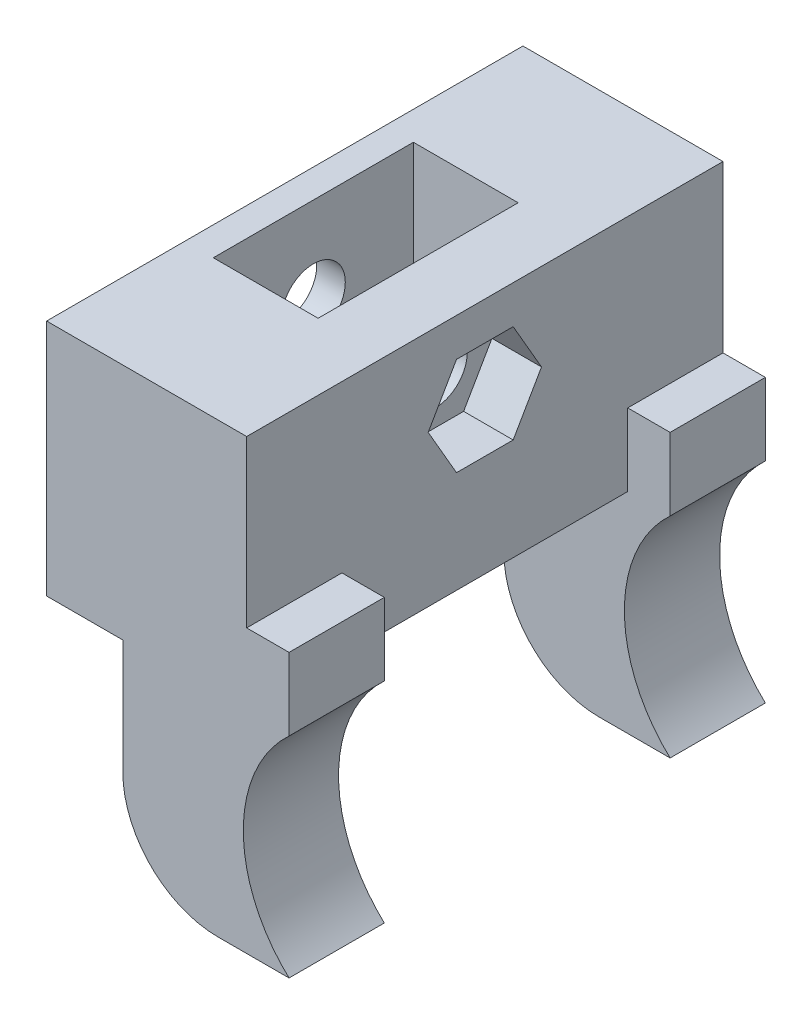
ISO-10303-21;
HEADER;
FILE_DESCRIPTION(('STEP AP214'),'2;1');
FILE_NAME('part.step','',(''),(''),'','','');
FILE_SCHEMA(('AUTOMOTIVE_DESIGN { 1 0 10303 214 1 1 1 1 }'));
ENDSEC;
DATA;
#1=APPLICATION_CONTEXT('core data for automotive mechanical design processes');
#2=APPLICATION_PROTOCOL_DEFINITION('international standard','automotive_design',2000,#1);
#3=PRODUCT_CONTEXT('',#1,'mechanical');
#4=PRODUCT('Part','Part','',(#3));
#5=PRODUCT_RELATED_PRODUCT_CATEGORY('part','',(#4));
#6=PRODUCT_DEFINITION_FORMATION('','',#4);
#7=PRODUCT_DEFINITION_CONTEXT('part definition',#1,'design');
#8=PRODUCT_DEFINITION('design','',#6,#7);
#9=PRODUCT_DEFINITION_SHAPE('','',#8);
#10=(LENGTH_UNIT() NAMED_UNIT(*) SI_UNIT(.MILLI.,.METRE.));
#11=(NAMED_UNIT(*) PLANE_ANGLE_UNIT() SI_UNIT($,.RADIAN.));
#12=(NAMED_UNIT(*) SI_UNIT($,.STERADIAN.) SOLID_ANGLE_UNIT());
#13=UNCERTAINTY_MEASURE_WITH_UNIT(LENGTH_MEASURE(1.E-05),#10,'distance_accuracy_value','');
#14=(GEOMETRIC_REPRESENTATION_CONTEXT(3) GLOBAL_UNCERTAINTY_ASSIGNED_CONTEXT((#13)) GLOBAL_UNIT_ASSIGNED_CONTEXT((#10,
#11,#12)) REPRESENTATION_CONTEXT('',''));
#15=CARTESIAN_POINT('',(0.,0.,0.));
#16=DIRECTION('',(0.,0.,1.));
#17=DIRECTION('',(1.,0.,0.));
#18=AXIS2_PLACEMENT_3D('',#15,#16,#17);
#19=CARTESIAN_POINT('',(-12.,-29.5726790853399,-25.));
#20=DIRECTION('',(0.,1.,0.));
#21=DIRECTION('',(0.,0.,1.));
#22=AXIS2_PLACEMENT_3D('',#19,#20,#21);
#23=PLANE('',#22);
#24=DIRECTION('',(1.,0.,0.));
#25=VECTOR('',#24,1.);
#26=CARTESIAN_POINT('',(-12.,-29.5726790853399,15.));
#27=LINE('',#26,#25);
#28=CARTESIAN_POINT('',(-12.,-29.5726790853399,15.));
#29=VERTEX_POINT('',#28);
#30=CARTESIAN_POINT('',(-7.55215673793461,-29.5726790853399,15.));
#31=VERTEX_POINT('',#30);
#32=EDGE_CURVE('E228',#29,#31,#27,.T.);
#33=ORIENTED_EDGE('',*,*,#32,.F.);
#34=DIRECTION('',(0.,0.,1.));
#35=VECTOR('',#34,1.);
#36=CARTESIAN_POINT('',(-12.,-29.5726790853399,-25.));
#37=LINE('',#36,#35);
#38=CARTESIAN_POINT('',(-12.,-29.5726790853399,25.));
#39=VERTEX_POINT('',#38);
#40=EDGE_CURVE('E399',#29,#39,#37,.T.);
#41=ORIENTED_EDGE('',*,*,#40,.T.);
#42=DIRECTION('',(-1.,0.,0.));
#43=VECTOR('',#42,1.);
#44=CARTESIAN_POINT('',(-12.,-29.5726790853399,25.));
#45=LINE('',#44,#43);
#46=CARTESIAN_POINT('',(-7.55215673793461,-29.5726790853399,25.));
#47=VERTEX_POINT('',#46);
#48=EDGE_CURVE('E389',#47,#39,#45,.T.);
#49=ORIENTED_EDGE('',*,*,#48,.F.);
#50=DIRECTION('',(0.,0.,1.));
#51=VECTOR('',#50,1.);
#52=CARTESIAN_POINT('',(-7.55215673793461,-29.5726790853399,-25.));
#53=LINE('',#52,#51);
#54=EDGE_CURVE('E253',#31,#47,#53,.T.);
#55=ORIENTED_EDGE('',*,*,#54,.F.);
#56=EDGE_LOOP('',(#33,#41,#49,#55));
#57=FACE_BOUND('',#56,.T.);
#58=ADVANCED_FACE('F37',(#57),#23,.T.);
#59=CARTESIAN_POINT('',(-7.55215673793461,-29.5726790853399,-25.));
#60=DIRECTION('',(1.,0.,0.));
#61=DIRECTION('',(0.,0.,-1.));
#62=AXIS2_PLACEMENT_3D('',#59,#60,#61);
#63=PLANE('',#62);
#64=DIRECTION('',(0.,1.,0.));
#65=VECTOR('',#64,1.);
#66=CARTESIAN_POINT('',(-7.55215673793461,-67.5024311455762,15.));
#67=LINE('',#66,#65);
#68=CARTESIAN_POINT('',(-7.55215673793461,-37.1745016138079,15.));
#69=VERTEX_POINT('',#68);
#70=EDGE_CURVE('E222',#69,#31,#67,.T.);
#71=ORIENTED_EDGE('',*,*,#70,.T.);
#72=ORIENTED_EDGE('',*,*,#54,.T.);
#73=DIRECTION('',(0.,1.,0.));
#74=VECTOR('',#73,1.);
#75=CARTESIAN_POINT('',(-7.55215673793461,-29.5726790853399,25.));
#76=LINE('',#75,#74);
#77=CARTESIAN_POINT('',(-7.55215673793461,-37.1745016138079,25.));
#78=VERTEX_POINT('',#77);
#79=EDGE_CURVE('E247',#78,#47,#76,.T.);
#80=ORIENTED_EDGE('',*,*,#79,.F.);
#81=DIRECTION('',(0.,0.,1.));
#82=VECTOR('',#81,1.);
#83=CARTESIAN_POINT('',(-7.55215673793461,-37.1745016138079,-25.));
#84=LINE('',#83,#82);
#85=EDGE_CURVE('E239',#69,#78,#84,.T.);
#86=ORIENTED_EDGE('',*,*,#85,.F.);
#87=EDGE_LOOP('',(#71,#72,#80,#86));
#88=FACE_BOUND('',#87,.T.);
#89=ADVANCED_FACE('F245',(#88),#63,.T.);
#90=CARTESIAN_POINT('',(-33.,-21.3245016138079,0.));
#91=DIRECTION('',(1.,0.,0.));
#92=DIRECTION('',(0.,0.,-1.));
#93=AXIS2_PLACEMENT_3D('',#90,#91,#92);
#94=CYLINDRICAL_SURFACE('',#93,3.35);
#95=CARTESIAN_POINT('',(-19.,-21.3245016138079,0.));
#96=DIRECTION('',(-1.,0.,0.));
#97=DIRECTION('',(0.,0.,1.));
#98=AXIS2_PLACEMENT_3D('',#95,#96,#97);
#99=CIRCLE('',#98,3.35);
#100=CARTESIAN_POINT('',(-19.,-21.3245016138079,3.35));
#101=VERTEX_POINT('',#100);
#102=EDGE_CURVE('E274',#101,#101,#99,.T.);
#103=ORIENTED_EDGE('',*,*,#102,.T.);
#104=EDGE_LOOP('',(#103));
#105=FACE_BOUND('',#104,.T.);
#106=CARTESIAN_POINT('',(-17.2,-21.3245016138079,0.));
#107=DIRECTION('',(1.,0.,0.));
#108=DIRECTION('',(0.,0.,-1.));
#109=AXIS2_PLACEMENT_3D('',#106,#107,#108);
#110=CIRCLE('',#109,3.35);
#111=CARTESIAN_POINT('',(-17.2,-21.3245016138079,-3.35));
#112=VERTEX_POINT('',#111);
#113=EDGE_CURVE('E41',#112,#112,#110,.F.);
#114=ORIENTED_EDGE('',*,*,#113,.F.);
#115=EDGE_LOOP('',(#114));
#116=FACE_BOUND('',#115,.T.);
#117=ADVANCED_FACE('F521',(#105,#116),#94,.F.);
#118=CARTESIAN_POINT('',(2.64588228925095,-48.1745016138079,-25.));
#119=DIRECTION('',(0.,0.,1.));
#120=DIRECTION('',(1.,0.,0.));
#121=AXIS2_PLACEMENT_3D('',#118,#119,#120);
#122=CYLINDRICAL_SURFACE('',#121,15.);
#123=CARTESIAN_POINT('',(2.64588228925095,-48.1745016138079,15.));
#124=DIRECTION('',(0.,0.,1.));
#125=DIRECTION('',(1.,0.,0.));
#126=AXIS2_PLACEMENT_3D('',#123,#124,#125);
#127=CIRCLE('',#126,15.);
#128=CARTESIAN_POINT('',(-7.55215673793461,-59.1745016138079,15.));
#129=VERTEX_POINT('',#128);
#130=EDGE_CURVE('E225',#69,#129,#127,.T.);
#131=ORIENTED_EDGE('',*,*,#130,.F.);
#132=ORIENTED_EDGE('',*,*,#85,.T.);
#133=CARTESIAN_POINT('',(2.64588228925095,-48.1745016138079,25.));
#134=DIRECTION('',(0.,0.,-1.));
#135=DIRECTION('',(1.,0.,0.));
#136=AXIS2_PLACEMENT_3D('',#133,#134,#135);
#137=CIRCLE('',#136,15.);
#138=CARTESIAN_POINT('',(-7.55215673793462,-59.1745016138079,25.));
#139=VERTEX_POINT('',#138);
#140=EDGE_CURVE('E386',#139,#78,#137,.T.);
#141=ORIENTED_EDGE('',*,*,#140,.F.);
#142=DIRECTION('',(0.,0.,1.));
#143=VECTOR('',#142,1.);
#144=CARTESIAN_POINT('',(-7.55215673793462,-59.1745016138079,-25.));
#145=LINE('',#144,#143);
#146=EDGE_CURVE('E241',#129,#139,#145,.T.);
#147=ORIENTED_EDGE('',*,*,#146,.F.);
#148=EDGE_LOOP('',(#131,#132,#141,#147));
#149=FACE_BOUND('',#148,.T.);
#150=ADVANCED_FACE('F237',(#149),#122,.F.);
#151=CARTESIAN_POINT('',(-15.,-59.1745016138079,-25.));
#152=DIRECTION('',(0.,-1.,0.));
#153=DIRECTION('',(0.,0.,-1.));
#154=AXIS2_PLACEMENT_3D('',#151,#152,#153);
#155=PLANE('',#154);
#156=DIRECTION('',(-1.,0.,0.));
#157=VECTOR('',#156,1.);
#158=CARTESIAN_POINT('',(-40.,-59.1745016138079,15.));
#159=LINE('',#158,#157);
#160=CARTESIAN_POINT('',(-15.,-59.1745016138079,15.));
#161=VERTEX_POINT('',#160);
#162=EDGE_CURVE('E297',#129,#161,#159,.T.);
#163=ORIENTED_EDGE('',*,*,#162,.F.);
#164=ORIENTED_EDGE('',*,*,#146,.T.);
#165=DIRECTION('',(1.,0.,0.));
#166=VECTOR('',#165,1.);
#167=CARTESIAN_POINT('',(-15.,-59.1745016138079,25.));
#168=LINE('',#167,#166);
#169=CARTESIAN_POINT('',(-15.,-59.1745016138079,25.));
#170=VERTEX_POINT('',#169);
#171=EDGE_CURVE('E383',#170,#139,#168,.T.);
#172=ORIENTED_EDGE('',*,*,#171,.F.);
#173=DIRECTION('',(0.,0.,1.));
#174=VECTOR('',#173,1.);
#175=CARTESIAN_POINT('',(-15.,-59.1745016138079,-25.));
#176=LINE('',#175,#174);
#177=EDGE_CURVE('E263',#161,#170,#176,.T.);
#178=ORIENTED_EDGE('',*,*,#177,.F.);
#179=EDGE_LOOP('',(#163,#164,#172,#178));
#180=FACE_BOUND('',#179,.T.);
#181=ADVANCED_FACE('F414',(#180),#155,.T.);
#182=CARTESIAN_POINT('',(-15.,-49.1745016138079,-25.));
#183=DIRECTION('',(0.,0.,1.));
#184=DIRECTION('',(1.,0.,0.));
#185=AXIS2_PLACEMENT_3D('',#182,#183,#184);
#186=CYLINDRICAL_SURFACE('',#185,10.);
#187=CARTESIAN_POINT('',(-15.,-49.1745016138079,15.));
#188=DIRECTION('',(0.,0.,1.));
#189=DIRECTION('',(1.,0.,0.));
#190=AXIS2_PLACEMENT_3D('',#187,#188,#189);
#191=CIRCLE('',#190,10.);
#192=CARTESIAN_POINT('',(-25.,-49.1745016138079,15.));
#193=VERTEX_POINT('',#192);
#194=EDGE_CURVE('E243',#161,#193,#191,.F.);
#195=ORIENTED_EDGE('',*,*,#194,.F.);
#196=ORIENTED_EDGE('',*,*,#177,.T.);
#197=CARTESIAN_POINT('',(-15.,-49.1745016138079,25.));
#198=DIRECTION('',(0.,0.,1.));
#199=DIRECTION('',(-1.,0.,0.));
#200=AXIS2_PLACEMENT_3D('',#197,#198,#199);
#201=CIRCLE('',#200,10.);
#202=CARTESIAN_POINT('',(-25.,-49.1745016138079,25.));
#203=VERTEX_POINT('',#202);
#204=EDGE_CURVE('E380',#203,#170,#201,.T.);
#205=ORIENTED_EDGE('',*,*,#204,.F.);
#206=DIRECTION('',(0.,0.,1.));
#207=VECTOR('',#206,1.);
#208=CARTESIAN_POINT('',(-25.,-49.1745016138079,-25.));
#209=LINE('',#208,#207);
#210=EDGE_CURVE('E267',#193,#203,#209,.T.);
#211=ORIENTED_EDGE('',*,*,#210,.F.);
#212=EDGE_LOOP('',(#195,#196,#205,#211));
#213=FACE_BOUND('',#212,.T.);
#214=ADVANCED_FACE('F419',(#213),#186,.T.);
#215=CARTESIAN_POINT('',(-25.,-37.1745016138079,-25.));
#216=DIRECTION('',(-1.,0.,0.));
#217=DIRECTION('',(0.,0.,1.));
#218=AXIS2_PLACEMENT_3D('',#215,#216,#217);
#219=PLANE('',#218);
#220=DIRECTION('',(0.,1.,0.));
#221=VECTOR('',#220,1.);
#222=CARTESIAN_POINT('',(-25.,-37.1745016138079,15.));
#223=LINE('',#222,#221);
#224=CARTESIAN_POINT('',(-25.,-37.1745016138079,15.));
#225=VERTEX_POINT('',#224);
#226=EDGE_CURVE('E308',#193,#225,#223,.T.);
#227=ORIENTED_EDGE('',*,*,#226,.F.);
#228=ORIENTED_EDGE('',*,*,#210,.T.);
#229=DIRECTION('',(0.,-1.,0.));
#230=VECTOR('',#229,1.);
#231=CARTESIAN_POINT('',(-25.,-37.1745016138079,25.));
#232=LINE('',#231,#230);
#233=CARTESIAN_POINT('',(-25.,-37.1745016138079,25.));
#234=VERTEX_POINT('',#233);
#235=EDGE_CURVE('E377',#234,#203,#232,.T.);
#236=ORIENTED_EDGE('',*,*,#235,.F.);
#237=DIRECTION('',(0.,0.,1.));
#238=VECTOR('',#237,1.);
#239=CARTESIAN_POINT('',(-25.,-37.1745016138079,-25.));
#240=LINE('',#239,#238);
#241=EDGE_CURVE('E271',#225,#234,#240,.T.);
#242=ORIENTED_EDGE('',*,*,#241,.F.);
#243=EDGE_LOOP('',(#227,#228,#236,#242));
#244=FACE_BOUND('',#243,.T.);
#245=ADVANCED_FACE('F422',(#244),#219,.T.);
#246=CARTESIAN_POINT('',(-33.,-12.1745016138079,-25.));
#247=DIRECTION('',(-1.,0.,0.));
#248=DIRECTION('',(0.,-1.,0.));
#249=AXIS2_PLACEMENT_3D('',#246,#247,#248);
#250=PLANE('',#249);
#251=CARTESIAN_POINT('',(-33.,-21.3245016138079,0.));
#252=DIRECTION('',(1.,0.,0.));
#253=DIRECTION('',(0.,0.,-1.));
#254=AXIS2_PLACEMENT_3D('',#251,#252,#253);
#255=CIRCLE('',#254,3.35);
#256=CARTESIAN_POINT('',(-33.,-21.3245016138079,-3.35));
#257=VERTEX_POINT('',#256);
#258=EDGE_CURVE('E277',#257,#257,#255,.T.);
#259=ORIENTED_EDGE('',*,*,#258,.T.);
#260=EDGE_LOOP('',(#259));
#261=FACE_BOUND('',#260,.T.);
#262=DIRECTION('',(0.,-1.,0.));
#263=VECTOR('',#262,1.);
#264=CARTESIAN_POINT('',(-33.,-12.1745016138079,25.));
#265=LINE('',#264,#263);
#266=CARTESIAN_POINT('',(-33.,-12.1745016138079,25.));
#267=VERTEX_POINT('',#266);
#268=CARTESIAN_POINT('',(-33.,-37.1745016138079,25.));
#269=VERTEX_POINT('',#268);
#270=EDGE_CURVE('E335',#267,#269,#265,.T.);
#271=ORIENTED_EDGE('',*,*,#270,.F.);
#272=DIRECTION('',(0.,0.,1.));
#273=VECTOR('',#272,1.);
#274=CARTESIAN_POINT('',(-33.,-12.1745016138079,-25.));
#275=LINE('',#274,#273);
#276=CARTESIAN_POINT('',(-33.,-12.1745016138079,-25.));
#277=VERTEX_POINT('',#276);
#278=EDGE_CURVE('E11',#277,#267,#275,.T.);
#279=ORIENTED_EDGE('',*,*,#278,.F.);
#280=DIRECTION('',(0.,-1.,0.));
#281=VECTOR('',#280,1.);
#282=CARTESIAN_POINT('',(-33.,-12.1745016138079,-25.));
#283=LINE('',#282,#281);
#284=CARTESIAN_POINT('',(-33.,-37.1745016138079,-25.));
#285=VERTEX_POINT('',#284);
#286=EDGE_CURVE('E342',#277,#285,#283,.T.);
#287=ORIENTED_EDGE('',*,*,#286,.T.);
#288=DIRECTION('',(0.,0.,1.));
#289=VECTOR('',#288,1.);
#290=CARTESIAN_POINT('',(-33.,-37.1745016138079,-25.));
#291=LINE('',#290,#289);
#292=EDGE_CURVE('E272',#285,#269,#291,.T.);
#293=ORIENTED_EDGE('',*,*,#292,.T.);
#294=EDGE_LOOP('',(#271,#279,#287,#293));
#295=FACE_BOUND('',#294,.T.);
#296=ADVANCED_FACE('F39',(#261,#295),#250,.T.);
#297=CARTESIAN_POINT('',(-33.,-12.1745016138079,-25.));
#298=DIRECTION('',(0.,1.,0.));
#299=DIRECTION('',(0.,0.,1.));
#300=AXIS2_PLACEMENT_3D('',#297,#298,#299);
#301=PLANE('',#300);
#302=DIRECTION('',(1.,0.,0.));
#303=VECTOR('',#302,1.);
#304=CARTESIAN_POINT('',(-30.,-12.1745016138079,10.5));
#305=LINE('',#304,#303);
#306=CARTESIAN_POINT('',(-30.,-12.1745016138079,10.5));
#307=VERTEX_POINT('',#306);
#308=CARTESIAN_POINT('',(-19.,-12.1745016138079,10.5));
#309=VERTEX_POINT('',#308);
#310=EDGE_CURVE('E242',#307,#309,#305,.T.);
#311=ORIENTED_EDGE('',*,*,#310,.F.);
#312=DIRECTION('',(0.,0.,1.));
#313=VECTOR('',#312,1.);
#314=CARTESIAN_POINT('',(-30.,-12.1745016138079,-10.5));
#315=LINE('',#314,#313);
#316=CARTESIAN_POINT('',(-30.,-12.1745016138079,-10.5));
#317=VERTEX_POINT('',#316);
#318=EDGE_CURVE('E316',#317,#307,#315,.T.);
#319=ORIENTED_EDGE('',*,*,#318,.F.);
#320=DIRECTION('',(1.,0.,0.));
#321=VECTOR('',#320,1.);
#322=CARTESIAN_POINT('',(-30.,-12.1745016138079,-10.5));
#323=LINE('',#322,#321);
#324=CARTESIAN_POINT('',(-19.,-12.1745016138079,-10.5));
#325=VERTEX_POINT('',#324);
#326=EDGE_CURVE('E328',#317,#325,#323,.T.);
#327=ORIENTED_EDGE('',*,*,#326,.T.);
#328=DIRECTION('',(0.,0.,1.));
#329=VECTOR('',#328,1.);
#330=CARTESIAN_POINT('',(-19.,-12.1745016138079,-10.5));
#331=LINE('',#330,#329);
#332=EDGE_CURVE('E325',#325,#309,#331,.T.);
#333=ORIENTED_EDGE('',*,*,#332,.T.);
#334=EDGE_LOOP('',(#311,#319,#327,#333));
#335=FACE_BOUND('',#334,.T.);
#336=DIRECTION('',(-1.,0.,0.));
#337=VECTOR('',#336,1.);
#338=CARTESIAN_POINT('',(-33.,-12.1745016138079,25.));
#339=LINE('',#338,#337);
#340=CARTESIAN_POINT('',(-12.,-12.1745016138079,25.));
#341=VERTEX_POINT('',#340);
#342=EDGE_CURVE('E346',#341,#267,#339,.T.);
#343=ORIENTED_EDGE('',*,*,#342,.F.);
#344=DIRECTION('',(0.,0.,1.));
#345=VECTOR('',#344,1.);
#346=CARTESIAN_POINT('',(-12.,-12.1745016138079,-25.));
#347=LINE('',#346,#345);
#348=CARTESIAN_POINT('',(-12.,-12.1745016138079,-25.));
#349=VERTEX_POINT('',#348);
#350=EDGE_CURVE('E46',#349,#341,#347,.T.);
#351=ORIENTED_EDGE('',*,*,#350,.F.);
#352=DIRECTION('',(-1.,0.,0.));
#353=VECTOR('',#352,1.);
#354=CARTESIAN_POINT('',(-33.,-12.1745016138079,-25.));
#355=LINE('',#354,#353);
#356=EDGE_CURVE('E273',#349,#277,#355,.T.);
#357=ORIENTED_EDGE('',*,*,#356,.T.);
#358=ORIENTED_EDGE('',*,*,#278,.T.);
#359=EDGE_LOOP('',(#343,#351,#357,#358));
#360=FACE_BOUND('',#359,.T.);
#361=ADVANCED_FACE('F531',(#335,#360),#301,.T.);
#362=CARTESIAN_POINT('',(-12.,-12.1745016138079,-25.));
#363=DIRECTION('',(1.,0.,0.));
#364=DIRECTION('',(0.,0.,-1.));
#365=AXIS2_PLACEMENT_3D('',#362,#363,#364);
#366=PLANE('',#365);
#367=DIRECTION('',(0.,0.866025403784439,-0.5));
#368=VECTOR('',#367,1.);
#369=CARTESIAN_POINT('',(-12.,-26.4745016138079,-2.97335388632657));
#370=LINE('',#369,#368);
#371=CARTESIAN_POINT('',(-12.,-26.4745016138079,-2.97335388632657));
#372=VERTEX_POINT('',#371);
#373=CARTESIAN_POINT('',(-12.,-21.3245016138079,-5.94670777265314));
#374=VERTEX_POINT('',#373);
#375=EDGE_CURVE('E62',#372,#374,#370,.T.);
#376=ORIENTED_EDGE('',*,*,#375,.F.);
#377=DIRECTION('',(0.,0.,-1.));
#378=VECTOR('',#377,1.);
#379=CARTESIAN_POINT('',(-12.,-26.4745016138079,2.97335388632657));
#380=LINE('',#379,#378);
#381=CARTESIAN_POINT('',(-12.,-26.4745016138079,2.97335388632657));
#382=VERTEX_POINT('',#381);
#383=EDGE_CURVE('E443',#382,#372,#380,.T.);
#384=ORIENTED_EDGE('',*,*,#383,.F.);
#385=DIRECTION('',(0.,-0.866025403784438,-0.5));
#386=VECTOR('',#385,1.);
#387=CARTESIAN_POINT('',(-12.,-21.3245016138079,5.94670777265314));
#388=LINE('',#387,#386);
#389=CARTESIAN_POINT('',(-12.,-21.3245016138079,5.94670777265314));
#390=VERTEX_POINT('',#389);
#391=EDGE_CURVE('E468',#390,#382,#388,.T.);
#392=ORIENTED_EDGE('',*,*,#391,.F.);
#393=DIRECTION('',(0.,-0.866025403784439,0.5));
#394=VECTOR('',#393,1.);
#395=CARTESIAN_POINT('',(-12.,-16.1745016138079,2.97335388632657));
#396=LINE('',#395,#394);
#397=CARTESIAN_POINT('',(-12.,-16.1745016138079,2.97335388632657));
#398=VERTEX_POINT('',#397);
#399=EDGE_CURVE('E465',#398,#390,#396,.T.);
#400=ORIENTED_EDGE('',*,*,#399,.F.);
#401=DIRECTION('',(0.,0.,1.));
#402=VECTOR('',#401,1.);
#403=CARTESIAN_POINT('',(-12.,-16.1745016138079,-2.97335388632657));
#404=LINE('',#403,#402);
#405=CARTESIAN_POINT('',(-12.,-16.1745016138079,-2.97335388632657));
#406=VERTEX_POINT('',#405);
#407=EDGE_CURVE('E462',#406,#398,#404,.T.);
#408=ORIENTED_EDGE('',*,*,#407,.F.);
#409=DIRECTION('',(0.,0.866025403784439,0.5));
#410=VECTOR('',#409,1.);
#411=CARTESIAN_POINT('',(-12.,-21.3245016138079,-5.94670777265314));
#412=LINE('',#411,#410);
#413=EDGE_CURVE('E459',#374,#406,#412,.T.);
#414=ORIENTED_EDGE('',*,*,#413,.F.);
#415=EDGE_LOOP('',(#376,#384,#392,#400,#408,#414));
#416=FACE_BOUND('',#415,.T.);
#417=DIRECTION('',(0.,1.,0.));
#418=VECTOR('',#417,1.);
#419=CARTESIAN_POINT('',(-12.,-12.1745016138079,25.));
#420=LINE('',#419,#418);
#421=EDGE_CURVE('E392',#39,#341,#420,.T.);
#422=ORIENTED_EDGE('',*,*,#421,.F.);
#423=ORIENTED_EDGE('',*,*,#40,.F.);
#424=DIRECTION('',(0.,1.,0.));
#425=VECTOR('',#424,1.);
#426=CARTESIAN_POINT('',(-12.,-67.5024311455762,15.));
#427=LINE('',#426,#425);
#428=CARTESIAN_POINT('',(-12.,-37.1745016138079,15.));
#429=VERTEX_POINT('',#428);
#430=EDGE_CURVE('E424',#429,#29,#427,.T.);
#431=ORIENTED_EDGE('',*,*,#430,.F.);
#432=DIRECTION('',(0.,0.,1.));
#433=VECTOR('',#432,1.);
#434=CARTESIAN_POINT('',(-12.,-37.1745016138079,-15.));
#435=LINE('',#434,#433);
#436=CARTESIAN_POINT('',(-12.,-37.1745016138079,-15.));
#437=VERTEX_POINT('',#436);
#438=EDGE_CURVE('E430',#437,#429,#435,.T.);
#439=ORIENTED_EDGE('',*,*,#438,.F.);
#440=DIRECTION('',(0.,1.,0.));
#441=VECTOR('',#440,1.);
#442=CARTESIAN_POINT('',(-12.,-67.5024311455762,-15.));
#443=LINE('',#442,#441);
#444=CARTESIAN_POINT('',(-12.,-29.5726790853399,-15.));
#445=VERTEX_POINT('',#444);
#446=EDGE_CURVE('E54',#437,#445,#443,.T.);
#447=ORIENTED_EDGE('',*,*,#446,.T.);
#448=CARTESIAN_POINT('',(-12.,-29.5726790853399,-25.));
#449=VERTEX_POINT('',#448);
#450=EDGE_CURVE('E397',#449,#445,#37,.T.);
#451=ORIENTED_EDGE('',*,*,#450,.F.);
#452=DIRECTION('',(0.,1.,0.));
#453=VECTOR('',#452,1.);
#454=CARTESIAN_POINT('',(-12.,-12.1745016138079,-25.));
#455=LINE('',#454,#453);
#456=EDGE_CURVE('E367',#449,#349,#455,.T.);
#457=ORIENTED_EDGE('',*,*,#456,.T.);
#458=ORIENTED_EDGE('',*,*,#350,.T.);
#459=EDGE_LOOP('',(#422,#423,#431,#439,#447,#451,#457,#458));
#460=FACE_BOUND('',#459,.T.);
#461=ADVANCED_FACE('F489',(#416,#460),#366,.T.);
#462=DIRECTION('',(-1.,0.,0.));
#463=VECTOR('',#462,1.);
#464=CARTESIAN_POINT('',(-12.,-29.5726790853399,-15.));
#465=LINE('',#464,#463);
#466=CARTESIAN_POINT('',(-7.55215673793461,-29.5726790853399,-15.));
#467=VERTEX_POINT('',#466);
#468=EDGE_CURVE('E233',#467,#445,#465,.T.);
#469=ORIENTED_EDGE('',*,*,#468,.F.);
#470=CARTESIAN_POINT('',(-7.55215673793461,-29.5726790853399,-25.));
#471=VERTEX_POINT('',#470);
#472=EDGE_CURVE('E257',#471,#467,#53,.T.);
#473=ORIENTED_EDGE('',*,*,#472,.F.);
#474=DIRECTION('',(-1.,0.,0.));
#475=VECTOR('',#474,1.);
#476=CARTESIAN_POINT('',(-12.,-29.5726790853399,-25.));
#477=LINE('',#476,#475);
#478=EDGE_CURVE('E364',#471,#449,#477,.T.);
#479=ORIENTED_EDGE('',*,*,#478,.T.);
#480=ORIENTED_EDGE('',*,*,#450,.T.);
#481=EDGE_LOOP('',(#469,#473,#479,#480));
#482=FACE_BOUND('',#481,.T.);
#483=ADVANCED_FACE('F517',(#482),#23,.T.);
#484=DIRECTION('',(0.,1.,0.));
#485=VECTOR('',#484,1.);
#486=CARTESIAN_POINT('',(-7.55215673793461,-67.5024311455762,-15.));
#487=LINE('',#486,#485);
#488=CARTESIAN_POINT('',(-7.55215673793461,-37.1745016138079,-15.));
#489=VERTEX_POINT('',#488);
#490=EDGE_CURVE('E232',#489,#467,#487,.T.);
#491=ORIENTED_EDGE('',*,*,#490,.F.);
#492=CARTESIAN_POINT('',(-7.55215673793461,-37.1745016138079,-25.));
#493=VERTEX_POINT('',#492);
#494=EDGE_CURVE('E249',#493,#489,#84,.T.);
#495=ORIENTED_EDGE('',*,*,#494,.F.);
#496=DIRECTION('',(0.,1.,0.));
#497=VECTOR('',#496,1.);
#498=CARTESIAN_POINT('',(-7.55215673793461,-29.5726790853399,-25.));
#499=LINE('',#498,#497);
#500=EDGE_CURVE('E361',#493,#471,#499,.T.);
#501=ORIENTED_EDGE('',*,*,#500,.T.);
#502=ORIENTED_EDGE('',*,*,#472,.T.);
#503=EDGE_LOOP('',(#491,#495,#501,#502));
#504=FACE_BOUND('',#503,.T.);
#505=ADVANCED_FACE('F523',(#504),#63,.T.);
#506=CARTESIAN_POINT('',(2.64588228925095,-48.1745016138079,-15.));
#507=DIRECTION('',(0.,0.,-1.));
#508=DIRECTION('',(-1.,0.,0.));
#509=AXIS2_PLACEMENT_3D('',#506,#507,#508);
#510=CIRCLE('',#509,15.);
#511=CARTESIAN_POINT('',(-7.55215673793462,-59.1745016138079,-15.));
#512=VERTEX_POINT('',#511);
#513=EDGE_CURVE('E305',#512,#489,#510,.T.);
#514=ORIENTED_EDGE('',*,*,#513,.F.);
#515=CARTESIAN_POINT('',(-7.55215673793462,-59.1745016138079,-25.));
#516=VERTEX_POINT('',#515);
#517=EDGE_CURVE('E250',#516,#512,#145,.T.);
#518=ORIENTED_EDGE('',*,*,#517,.F.);
#519=CARTESIAN_POINT('',(2.64588228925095,-48.1745016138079,-25.));
#520=DIRECTION('',(0.,0.,-1.));
#521=DIRECTION('',(1.,0.,0.));
#522=AXIS2_PLACEMENT_3D('',#519,#520,#521);
#523=CIRCLE('',#522,15.);
#524=EDGE_CURVE('E358',#516,#493,#523,.T.);
#525=ORIENTED_EDGE('',*,*,#524,.T.);
#526=ORIENTED_EDGE('',*,*,#494,.T.);
#527=EDGE_LOOP('',(#514,#518,#525,#526));
#528=FACE_BOUND('',#527,.T.);
#529=ADVANCED_FACE('F530',(#528),#122,.F.);
#530=DIRECTION('',(1.,0.,0.));
#531=VECTOR('',#530,1.);
#532=CARTESIAN_POINT('',(-40.,-59.1745016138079,-15.));
#533=LINE('',#532,#531);
#534=CARTESIAN_POINT('',(-15.,-59.1745016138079,-15.));
#535=VERTEX_POINT('',#534);
#536=EDGE_CURVE('E281',#535,#512,#533,.T.);
#537=ORIENTED_EDGE('',*,*,#536,.F.);
#538=CARTESIAN_POINT('',(-15.,-59.1745016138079,-25.));
#539=VERTEX_POINT('',#538);
#540=EDGE_CURVE('E260',#539,#535,#176,.T.);
#541=ORIENTED_EDGE('',*,*,#540,.F.);
#542=DIRECTION('',(1.,0.,0.));
#543=VECTOR('',#542,1.);
#544=CARTESIAN_POINT('',(-15.,-59.1745016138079,-25.));
#545=LINE('',#544,#543);
#546=EDGE_CURVE('E355',#539,#516,#545,.T.);
#547=ORIENTED_EDGE('',*,*,#546,.T.);
#548=ORIENTED_EDGE('',*,*,#517,.T.);
#549=EDGE_LOOP('',(#537,#541,#547,#548));
#550=FACE_BOUND('',#549,.T.);
#551=ADVANCED_FACE('F545',(#550),#155,.T.);
#552=CARTESIAN_POINT('',(-15.,-49.1745016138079,-15.));
#553=DIRECTION('',(0.,0.,-1.));
#554=DIRECTION('',(-1.,0.,0.));
#555=AXIS2_PLACEMENT_3D('',#552,#553,#554);
#556=CIRCLE('',#555,10.);
#557=CARTESIAN_POINT('',(-25.,-49.1745016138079,-15.));
#558=VERTEX_POINT('',#557);
#559=EDGE_CURVE('E303',#558,#535,#556,.F.);
#560=ORIENTED_EDGE('',*,*,#559,.F.);
#561=CARTESIAN_POINT('',(-25.,-49.1745016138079,-25.));
#562=VERTEX_POINT('',#561);
#563=EDGE_CURVE('E264',#562,#558,#209,.T.);
#564=ORIENTED_EDGE('',*,*,#563,.F.);
#565=CARTESIAN_POINT('',(-15.,-49.1745016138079,-25.));
#566=DIRECTION('',(0.,0.,1.));
#567=DIRECTION('',(-1.,0.,0.));
#568=AXIS2_PLACEMENT_3D('',#565,#566,#567);
#569=CIRCLE('',#568,10.);
#570=EDGE_CURVE('E352',#562,#539,#569,.T.);
#571=ORIENTED_EDGE('',*,*,#570,.T.);
#572=ORIENTED_EDGE('',*,*,#540,.T.);
#573=EDGE_LOOP('',(#560,#564,#571,#572));
#574=FACE_BOUND('',#573,.T.);
#575=ADVANCED_FACE('F550',(#574),#186,.T.);
#576=DIRECTION('',(0.,-1.,0.));
#577=VECTOR('',#576,1.);
#578=CARTESIAN_POINT('',(-25.,-37.1745016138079,-15.));
#579=LINE('',#578,#577);
#580=CARTESIAN_POINT('',(-25.,-37.1745016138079,-15.));
#581=VERTEX_POINT('',#580);
#582=EDGE_CURVE('E301',#581,#558,#579,.T.);
#583=ORIENTED_EDGE('',*,*,#582,.F.);
#584=CARTESIAN_POINT('',(-25.,-37.1745016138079,-25.));
#585=VERTEX_POINT('',#584);
#586=EDGE_CURVE('E268',#585,#581,#240,.T.);
#587=ORIENTED_EDGE('',*,*,#586,.F.);
#588=DIRECTION('',(0.,-1.,0.));
#589=VECTOR('',#588,1.);
#590=CARTESIAN_POINT('',(-25.,-37.1745016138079,-25.));
#591=LINE('',#590,#589);
#592=EDGE_CURVE('E349',#585,#562,#591,.T.);
#593=ORIENTED_EDGE('',*,*,#592,.T.);
#594=ORIENTED_EDGE('',*,*,#563,.T.);
#595=EDGE_LOOP('',(#583,#587,#593,#594));
#596=FACE_BOUND('',#595,.T.);
#597=ADVANCED_FACE('F553',(#596),#219,.T.);
#598=CARTESIAN_POINT('',(-33.,-37.1745016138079,-25.));
#599=DIRECTION('',(0.,-1.,0.));
#600=DIRECTION('',(0.,0.,-1.));
#601=AXIS2_PLACEMENT_3D('',#598,#599,#600);
#602=PLANE('',#601);
#603=ORIENTED_EDGE('',*,*,#438,.T.);
#604=DIRECTION('',(1.,0.,0.));
#605=VECTOR('',#604,1.);
#606=CARTESIAN_POINT('',(-40.,-37.1745016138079,15.));
#607=LINE('',#606,#605);
#608=EDGE_CURVE('E293',#225,#429,#607,.T.);
#609=ORIENTED_EDGE('',*,*,#608,.F.);
#610=ORIENTED_EDGE('',*,*,#241,.T.);
#611=DIRECTION('',(1.,0.,0.));
#612=VECTOR('',#611,1.);
#613=CARTESIAN_POINT('',(-33.,-37.1745016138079,25.));
#614=LINE('',#613,#612);
#615=EDGE_CURVE('E374',#269,#234,#614,.T.);
#616=ORIENTED_EDGE('',*,*,#615,.F.);
#617=ORIENTED_EDGE('',*,*,#292,.F.);
#618=DIRECTION('',(1.,0.,0.));
#619=VECTOR('',#618,1.);
#620=CARTESIAN_POINT('',(-33.,-37.1745016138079,-25.));
#621=LINE('',#620,#619);
#622=EDGE_CURVE('E345',#285,#585,#621,.T.);
#623=ORIENTED_EDGE('',*,*,#622,.T.);
#624=ORIENTED_EDGE('',*,*,#586,.T.);
#625=DIRECTION('',(-1.,0.,0.));
#626=VECTOR('',#625,1.);
#627=CARTESIAN_POINT('',(-40.,-37.1745016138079,-15.));
#628=LINE('',#627,#626);
#629=EDGE_CURVE('E296',#437,#581,#628,.T.);
#630=ORIENTED_EDGE('',*,*,#629,.F.);
#631=EDGE_LOOP('',(#603,#609,#610,#616,#617,#623,#624,#630));
#632=FACE_BOUND('',#631,.T.);
#633=ADVANCED_FACE('F427',(#632),#602,.T.);
#634=CARTESIAN_POINT('',(-15.,-49.1745016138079,-25.));
#635=DIRECTION('',(0.,0.,-1.));
#636=DIRECTION('',(-1.,0.,0.));
#637=AXIS2_PLACEMENT_3D('',#634,#635,#636);
#638=PLANE('',#637);
#639=ORIENTED_EDGE('',*,*,#286,.F.);
#640=ORIENTED_EDGE('',*,*,#356,.F.);
#641=ORIENTED_EDGE('',*,*,#456,.F.);
#642=ORIENTED_EDGE('',*,*,#478,.F.);
#643=ORIENTED_EDGE('',*,*,#500,.F.);
#644=ORIENTED_EDGE('',*,*,#524,.F.);
#645=ORIENTED_EDGE('',*,*,#546,.F.);
#646=ORIENTED_EDGE('',*,*,#570,.F.);
#647=ORIENTED_EDGE('',*,*,#592,.F.);
#648=ORIENTED_EDGE('',*,*,#622,.F.);
#649=EDGE_LOOP('',(#639,#640,#641,#642,#643,#644,#645,#646,#647,#648));
#650=FACE_BOUND('',#649,.T.);
#651=ADVANCED_FACE('F540',(#650),#638,.T.);
#652=CARTESIAN_POINT('',(-15.,-49.1745016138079,25.));
#653=DIRECTION('',(0.,0.,-1.));
#654=DIRECTION('',(-1.,0.,0.));
#655=AXIS2_PLACEMENT_3D('',#652,#653,#654);
#656=PLANE('',#655);
#657=ORIENTED_EDGE('',*,*,#270,.T.);
#658=ORIENTED_EDGE('',*,*,#615,.T.);
#659=ORIENTED_EDGE('',*,*,#235,.T.);
#660=ORIENTED_EDGE('',*,*,#204,.T.);
#661=ORIENTED_EDGE('',*,*,#171,.T.);
#662=ORIENTED_EDGE('',*,*,#140,.T.);
#663=ORIENTED_EDGE('',*,*,#79,.T.);
#664=ORIENTED_EDGE('',*,*,#48,.T.);
#665=ORIENTED_EDGE('',*,*,#421,.T.);
#666=ORIENTED_EDGE('',*,*,#342,.T.);
#667=EDGE_LOOP('',(#657,#658,#659,#660,#661,#662,#663,#664,#665,#666));
#668=FACE_BOUND('',#667,.T.);
#669=ADVANCED_FACE('F409',(#668),#656,.F.);
#670=CARTESIAN_POINT('',(-30.,-30.4745016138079,10.5));
#671=DIRECTION('',(0.,0.,1.));
#672=DIRECTION('',(1.,0.,0.));
#673=AXIS2_PLACEMENT_3D('',#670,#671,#672);
#674=PLANE('',#673);
#675=ORIENTED_EDGE('',*,*,#310,.T.);
#676=DIRECTION('',(0.,1.,0.));
#677=VECTOR('',#676,1.);
#678=CARTESIAN_POINT('',(-19.,-30.4745016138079,10.5));
#679=LINE('',#678,#677);
#680=CARTESIAN_POINT('',(-19.,-30.4745016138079,10.5));
#681=VERTEX_POINT('',#680);
#682=EDGE_CURVE('E323',#681,#309,#679,.T.);
#683=ORIENTED_EDGE('',*,*,#682,.F.);
#684=DIRECTION('',(1.,0.,0.));
#685=VECTOR('',#684,1.);
#686=CARTESIAN_POINT('',(-30.,-30.4745016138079,10.5));
#687=LINE('',#686,#685);
#688=CARTESIAN_POINT('',(-30.,-30.4745016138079,10.5));
#689=VERTEX_POINT('',#688);
#690=EDGE_CURVE('E312',#689,#681,#687,.T.);
#691=ORIENTED_EDGE('',*,*,#690,.F.);
#692=DIRECTION('',(0.,1.,0.));
#693=VECTOR('',#692,1.);
#694=CARTESIAN_POINT('',(-30.,-30.4745016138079,10.5));
#695=LINE('',#694,#693);
#696=EDGE_CURVE('E333',#689,#307,#695,.T.);
#697=ORIENTED_EDGE('',*,*,#696,.T.);
#698=EDGE_LOOP('',(#675,#683,#691,#697));
#699=FACE_BOUND('',#698,.T.);
#700=ADVANCED_FACE('F570',(#699),#674,.F.);
#701=CARTESIAN_POINT('',(-30.,-30.4745016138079,-10.5));
#702=DIRECTION('',(-1.,0.,0.));
#703=DIRECTION('',(0.,0.,1.));
#704=AXIS2_PLACEMENT_3D('',#701,#702,#703);
#705=PLANE('',#704);
#706=CARTESIAN_POINT('',(-30.,-21.3245016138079,0.));
#707=DIRECTION('',(-1.,0.,0.));
#708=DIRECTION('',(0.,0.,1.));
#709=AXIS2_PLACEMENT_3D('',#706,#707,#708);
#710=CIRCLE('',#709,3.35);
#711=CARTESIAN_POINT('',(-30.,-21.3245016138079,3.35));
#712=VERTEX_POINT('',#711);
#713=EDGE_CURVE('E276',#712,#712,#710,.T.);
#714=ORIENTED_EDGE('',*,*,#713,.T.);
#715=EDGE_LOOP('',(#714));
#716=FACE_BOUND('',#715,.T.);
#717=ORIENTED_EDGE('',*,*,#318,.T.);
#718=ORIENTED_EDGE('',*,*,#696,.F.);
#719=DIRECTION('',(0.,0.,1.));
#720=VECTOR('',#719,1.);
#721=CARTESIAN_POINT('',(-30.,-30.4745016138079,-10.5));
#722=LINE('',#721,#720);
#723=CARTESIAN_POINT('',(-30.,-30.4745016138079,-10.5));
#724=VERTEX_POINT('',#723);
#725=EDGE_CURVE('E320',#724,#689,#722,.T.);
#726=ORIENTED_EDGE('',*,*,#725,.F.);
#727=DIRECTION('',(0.,1.,0.));
#728=VECTOR('',#727,1.);
#729=CARTESIAN_POINT('',(-30.,-30.4745016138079,-10.5));
#730=LINE('',#729,#728);
#731=EDGE_CURVE('E336',#724,#317,#730,.T.);
#732=ORIENTED_EDGE('',*,*,#731,.T.);
#733=EDGE_LOOP('',(#717,#718,#726,#732));
#734=FACE_BOUND('',#733,.T.);
#735=ADVANCED_FACE('F575',(#716,#734),#705,.F.);
#736=CARTESIAN_POINT('',(-30.,-30.4745016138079,-10.5));
#737=DIRECTION('',(0.,0.,1.));
#738=DIRECTION('',(1.,0.,0.));
#739=AXIS2_PLACEMENT_3D('',#736,#737,#738);
#740=PLANE('',#739);
#741=ORIENTED_EDGE('',*,*,#326,.F.);
#742=ORIENTED_EDGE('',*,*,#731,.F.);
#743=DIRECTION('',(1.,0.,0.));
#744=VECTOR('',#743,1.);
#745=CARTESIAN_POINT('',(-30.,-30.4745016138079,-10.5));
#746=LINE('',#745,#744);
#747=CARTESIAN_POINT('',(-19.,-30.4745016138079,-10.5));
#748=VERTEX_POINT('',#747);
#749=EDGE_CURVE('E318',#724,#748,#746,.T.);
#750=ORIENTED_EDGE('',*,*,#749,.T.);
#751=DIRECTION('',(0.,1.,0.));
#752=VECTOR('',#751,1.);
#753=CARTESIAN_POINT('',(-19.,-30.4745016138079,-10.5));
#754=LINE('',#753,#752);
#755=EDGE_CURVE('E338',#748,#325,#754,.T.);
#756=ORIENTED_EDGE('',*,*,#755,.T.);
#757=EDGE_LOOP('',(#741,#742,#750,#756));
#758=FACE_BOUND('',#757,.T.);
#759=ADVANCED_FACE('F581',(#758),#740,.T.);
#760=CARTESIAN_POINT('',(-19.,-30.4745016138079,-10.5));
#761=DIRECTION('',(-1.,0.,0.));
#762=DIRECTION('',(0.,0.,1.));
#763=AXIS2_PLACEMENT_3D('',#760,#761,#762);
#764=PLANE('',#763);
#765=ORIENTED_EDGE('',*,*,#102,.F.);
#766=EDGE_LOOP('',(#765));
#767=FACE_BOUND('',#766,.T.);
#768=ORIENTED_EDGE('',*,*,#332,.F.);
#769=ORIENTED_EDGE('',*,*,#755,.F.);
#770=DIRECTION('',(0.,0.,1.));
#771=VECTOR('',#770,1.);
#772=CARTESIAN_POINT('',(-19.,-30.4745016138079,-10.5));
#773=LINE('',#772,#771);
#774=EDGE_CURVE('E315',#748,#681,#773,.T.);
#775=ORIENTED_EDGE('',*,*,#774,.T.);
#776=ORIENTED_EDGE('',*,*,#682,.T.);
#777=EDGE_LOOP('',(#768,#769,#775,#776));
#778=FACE_BOUND('',#777,.T.);
#779=ADVANCED_FACE('F577',(#767,#778),#764,.T.);
#780=CARTESIAN_POINT('',(0.,-30.4745016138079,0.));
#781=DIRECTION('',(0.,-1.,0.));
#782=DIRECTION('',(0.,0.,-1.));
#783=AXIS2_PLACEMENT_3D('',#780,#781,#782);
#784=PLANE('',#783);
#785=ORIENTED_EDGE('',*,*,#690,.T.);
#786=ORIENTED_EDGE('',*,*,#774,.F.);
#787=ORIENTED_EDGE('',*,*,#749,.F.);
#788=ORIENTED_EDGE('',*,*,#725,.T.);
#789=EDGE_LOOP('',(#785,#786,#787,#788));
#790=FACE_BOUND('',#789,.T.);
#791=ADVANCED_FACE('F580',(#790),#784,.F.);
#792=CARTESIAN_POINT('',(-40.,7.01670262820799,15.));
#793=DIRECTION('',(0.,0.,1.));
#794=DIRECTION('',(1.,0.,0.));
#795=AXIS2_PLACEMENT_3D('',#792,#793,#794);
#796=PLANE('',#795);
#797=ORIENTED_EDGE('',*,*,#130,.T.);
#798=ORIENTED_EDGE('',*,*,#162,.T.);
#799=ORIENTED_EDGE('',*,*,#194,.T.);
#800=ORIENTED_EDGE('',*,*,#226,.T.);
#801=ORIENTED_EDGE('',*,*,#608,.T.);
#802=ORIENTED_EDGE('',*,*,#430,.T.);
#803=ORIENTED_EDGE('',*,*,#32,.T.);
#804=ORIENTED_EDGE('',*,*,#70,.F.);
#805=EDGE_LOOP('',(#797,#798,#799,#800,#801,#802,#803,#804));
#806=FACE_BOUND('',#805,.T.);
#807=ADVANCED_FACE('F224',(#806),#796,.F.);
#808=CARTESIAN_POINT('',(-40.,7.01670262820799,-15.));
#809=DIRECTION('',(0.,0.,-1.));
#810=DIRECTION('',(-1.,0.,0.));
#811=AXIS2_PLACEMENT_3D('',#808,#809,#810);
#812=PLANE('',#811);
#813=ORIENTED_EDGE('',*,*,#513,.T.);
#814=ORIENTED_EDGE('',*,*,#490,.T.);
#815=ORIENTED_EDGE('',*,*,#468,.T.);
#816=ORIENTED_EDGE('',*,*,#446,.F.);
#817=ORIENTED_EDGE('',*,*,#629,.T.);
#818=ORIENTED_EDGE('',*,*,#582,.T.);
#819=ORIENTED_EDGE('',*,*,#559,.T.);
#820=ORIENTED_EDGE('',*,*,#536,.T.);
#821=EDGE_LOOP('',(#813,#814,#815,#816,#817,#818,#819,#820));
#822=FACE_BOUND('',#821,.T.);
#823=ADVANCED_FACE('F533',(#822),#812,.F.);
#824=ORIENTED_EDGE('',*,*,#258,.F.);
#825=EDGE_LOOP('',(#824));
#826=FACE_BOUND('',#825,.T.);
#827=ORIENTED_EDGE('',*,*,#713,.F.);
#828=EDGE_LOOP('',(#827));
#829=FACE_BOUND('',#828,.T.);
#830=ADVANCED_FACE('F594',(#826,#829),#94,.F.);
#831=CARTESIAN_POINT('',(-17.2,0.,0.));
#832=DIRECTION('',(1.,0.,0.));
#833=DIRECTION('',(0.,0.,-1.));
#834=AXIS2_PLACEMENT_3D('',#831,#832,#833);
#835=PLANE('',#834);
#836=DIRECTION('',(0.,0.866025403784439,-0.5));
#837=VECTOR('',#836,1.);
#838=CARTESIAN_POINT('',(-17.2,-26.4745016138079,-2.97335388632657));
#839=LINE('',#838,#837);
#840=CARTESIAN_POINT('',(-17.2,-26.4745016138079,-2.97335388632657));
#841=VERTEX_POINT('',#840);
#842=CARTESIAN_POINT('',(-17.2,-21.3245016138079,-5.94670777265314));
#843=VERTEX_POINT('',#842);
#844=EDGE_CURVE('E439',#841,#843,#839,.T.);
#845=ORIENTED_EDGE('',*,*,#844,.T.);
#846=DIRECTION('',(0.,0.866025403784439,0.5));
#847=VECTOR('',#846,1.);
#848=CARTESIAN_POINT('',(-17.2,-21.3245016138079,-5.94670777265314));
#849=LINE('',#848,#847);
#850=CARTESIAN_POINT('',(-17.2,-16.1745016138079,-2.97335388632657));
#851=VERTEX_POINT('',#850);
#852=EDGE_CURVE('E442',#843,#851,#849,.T.);
#853=ORIENTED_EDGE('',*,*,#852,.T.);
#854=DIRECTION('',(0.,0.,1.));
#855=VECTOR('',#854,1.);
#856=CARTESIAN_POINT('',(-17.2,-16.1745016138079,-2.97335388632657));
#857=LINE('',#856,#855);
#858=CARTESIAN_POINT('',(-17.2,-16.1745016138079,2.97335388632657));
#859=VERTEX_POINT('',#858);
#860=EDGE_CURVE('E446',#851,#859,#857,.T.);
#861=ORIENTED_EDGE('',*,*,#860,.T.);
#862=DIRECTION('',(0.,-0.866025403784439,0.5));
#863=VECTOR('',#862,1.);
#864=CARTESIAN_POINT('',(-17.2,-16.1745016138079,2.97335388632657));
#865=LINE('',#864,#863);
#866=CARTESIAN_POINT('',(-17.2,-21.3245016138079,5.94670777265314));
#867=VERTEX_POINT('',#866);
#868=EDGE_CURVE('E449',#859,#867,#865,.T.);
#869=ORIENTED_EDGE('',*,*,#868,.T.);
#870=DIRECTION('',(0.,-0.866025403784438,-0.5));
#871=VECTOR('',#870,1.);
#872=CARTESIAN_POINT('',(-17.2,-21.3245016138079,5.94670777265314));
#873=LINE('',#872,#871);
#874=CARTESIAN_POINT('',(-17.2,-26.4745016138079,2.97335388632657));
#875=VERTEX_POINT('',#874);
#876=EDGE_CURVE('E452',#867,#875,#873,.T.);
#877=ORIENTED_EDGE('',*,*,#876,.T.);
#878=DIRECTION('',(0.,0.,-1.));
#879=VECTOR('',#878,1.);
#880=CARTESIAN_POINT('',(-17.2,-26.4745016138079,2.97335388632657));
#881=LINE('',#880,#879);
#882=EDGE_CURVE('E455',#875,#841,#881,.T.);
#883=ORIENTED_EDGE('',*,*,#882,.T.);
#884=EDGE_LOOP('',(#845,#853,#861,#869,#877,#883));
#885=FACE_BOUND('',#884,.T.);
#886=ORIENTED_EDGE('',*,*,#113,.T.);
#887=EDGE_LOOP('',(#886));
#888=FACE_BOUND('',#887,.T.);
#889=ADVANCED_FACE('F499',(#885,#888),#835,.T.);
#890=CARTESIAN_POINT('',(-17.2,-26.4745016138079,-2.97335388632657));
#891=DIRECTION('',(0.,-0.5,-0.866025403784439));
#892=DIRECTION('',(0.,0.866025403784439,-0.5));
#893=AXIS2_PLACEMENT_3D('',#890,#891,#892);
#894=PLANE('',#893);
#895=ORIENTED_EDGE('',*,*,#375,.T.);
#896=DIRECTION('',(1.,0.,0.));
#897=VECTOR('',#896,1.);
#898=CARTESIAN_POINT('',(-17.2,-21.3245016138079,-5.94670777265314));
#899=LINE('',#898,#897);
#900=EDGE_CURVE('E290',#843,#374,#899,.T.);
#901=ORIENTED_EDGE('',*,*,#900,.F.);
#902=ORIENTED_EDGE('',*,*,#844,.F.);
#903=DIRECTION('',(1.,0.,0.));
#904=VECTOR('',#903,1.);
#905=CARTESIAN_POINT('',(-17.2,-26.4745016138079,-2.97335388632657));
#906=LINE('',#905,#904);
#907=EDGE_CURVE('E288',#841,#372,#906,.T.);
#908=ORIENTED_EDGE('',*,*,#907,.T.);
#909=EDGE_LOOP('',(#895,#901,#902,#908));
#910=FACE_BOUND('',#909,.T.);
#911=ADVANCED_FACE('F502',(#910),#894,.F.);
#912=CARTESIAN_POINT('',(-17.2,-26.4745016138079,2.97335388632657));
#913=DIRECTION('',(0.,-1.,0.));
#914=DIRECTION('',(0.,0.,-1.));
#915=AXIS2_PLACEMENT_3D('',#912,#913,#914);
#916=PLANE('',#915);
#917=ORIENTED_EDGE('',*,*,#383,.T.);
#918=ORIENTED_EDGE('',*,*,#907,.F.);
#919=ORIENTED_EDGE('',*,*,#882,.F.);
#920=DIRECTION('',(1.,0.,0.));
#921=VECTOR('',#920,1.);
#922=CARTESIAN_POINT('',(-17.2,-26.4745016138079,2.97335388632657));
#923=LINE('',#922,#921);
#924=EDGE_CURVE('E474',#875,#382,#923,.T.);
#925=ORIENTED_EDGE('',*,*,#924,.T.);
#926=EDGE_LOOP('',(#917,#918,#919,#925));
#927=FACE_BOUND('',#926,.T.);
#928=ADVANCED_FACE('F504',(#927),#916,.F.);
#929=CARTESIAN_POINT('',(-17.2,-21.3245016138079,5.94670777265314));
#930=DIRECTION('',(0.,-0.5,0.866025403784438));
#931=DIRECTION('',(0.,-0.866025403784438,-0.5));
#932=AXIS2_PLACEMENT_3D('',#929,#930,#931);
#933=PLANE('',#932);
#934=ORIENTED_EDGE('',*,*,#391,.T.);
#935=ORIENTED_EDGE('',*,*,#924,.F.);
#936=ORIENTED_EDGE('',*,*,#876,.F.);
#937=DIRECTION('',(1.,0.,0.));
#938=VECTOR('',#937,1.);
#939=CARTESIAN_POINT('',(-17.2,-21.3245016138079,5.94670777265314));
#940=LINE('',#939,#938);
#941=EDGE_CURVE('E476',#867,#390,#940,.T.);
#942=ORIENTED_EDGE('',*,*,#941,.T.);
#943=EDGE_LOOP('',(#934,#935,#936,#942));
#944=FACE_BOUND('',#943,.T.);
#945=ADVANCED_FACE('F506',(#944),#933,.F.);
#946=CARTESIAN_POINT('',(-17.2,-16.1745016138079,2.97335388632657));
#947=DIRECTION('',(0.,0.5,0.866025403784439));
#948=DIRECTION('',(0.,-0.866025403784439,0.5));
#949=AXIS2_PLACEMENT_3D('',#946,#947,#948);
#950=PLANE('',#949);
#951=ORIENTED_EDGE('',*,*,#399,.T.);
#952=ORIENTED_EDGE('',*,*,#941,.F.);
#953=ORIENTED_EDGE('',*,*,#868,.F.);
#954=DIRECTION('',(1.,0.,0.));
#955=VECTOR('',#954,1.);
#956=CARTESIAN_POINT('',(-17.2,-16.1745016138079,2.97335388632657));
#957=LINE('',#956,#955);
#958=EDGE_CURVE('E478',#859,#398,#957,.T.);
#959=ORIENTED_EDGE('',*,*,#958,.T.);
#960=EDGE_LOOP('',(#951,#952,#953,#959));
#961=FACE_BOUND('',#960,.T.);
#962=ADVANCED_FACE('F496',(#961),#950,.F.);
#963=CARTESIAN_POINT('',(-17.2,-16.1745016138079,-2.97335388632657));
#964=DIRECTION('',(0.,1.,0.));
#965=DIRECTION('',(0.,0.,1.));
#966=AXIS2_PLACEMENT_3D('',#963,#964,#965);
#967=PLANE('',#966);
#968=ORIENTED_EDGE('',*,*,#407,.T.);
#969=ORIENTED_EDGE('',*,*,#958,.F.);
#970=ORIENTED_EDGE('',*,*,#860,.F.);
#971=DIRECTION('',(1.,0.,0.));
#972=VECTOR('',#971,1.);
#973=CARTESIAN_POINT('',(-17.2,-16.1745016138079,-2.97335388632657));
#974=LINE('',#973,#972);
#975=EDGE_CURVE('E479',#851,#406,#974,.T.);
#976=ORIENTED_EDGE('',*,*,#975,.T.);
#977=EDGE_LOOP('',(#968,#969,#970,#976));
#978=FACE_BOUND('',#977,.T.);
#979=ADVANCED_FACE('F493',(#978),#967,.F.);
#980=CARTESIAN_POINT('',(-17.2,-21.3245016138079,-5.94670777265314));
#981=DIRECTION('',(0.,0.5,-0.866025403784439));
#982=DIRECTION('',(0.,0.866025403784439,0.5));
#983=AXIS2_PLACEMENT_3D('',#980,#981,#982);
#984=PLANE('',#983);
#985=ORIENTED_EDGE('',*,*,#413,.T.);
#986=ORIENTED_EDGE('',*,*,#975,.F.);
#987=ORIENTED_EDGE('',*,*,#852,.F.);
#988=ORIENTED_EDGE('',*,*,#900,.T.);
#989=EDGE_LOOP('',(#985,#986,#987,#988));
#990=FACE_BOUND('',#989,.T.);
#991=ADVANCED_FACE('F485',(#990),#984,.F.);
#992=CLOSED_SHELL('',(#58,#89,#117,#150,#181,#214,#245,#296,#361,#461,#483,#505,#529,#551,#575,
#597,#633,#651,#669,#700,#735,#759,#779,#791,#807,#823,#830,#889,#911,#928,#945,#962,#979,#991));
#993=MANIFOLD_SOLID_BREP('B2',#992);
#994=ADVANCED_BREP_SHAPE_REPRESENTATION('',(#18,#993),#14);
#995=SHAPE_DEFINITION_REPRESENTATION(#9,#994);
ENDSEC;
END-ISO-10303-21;
